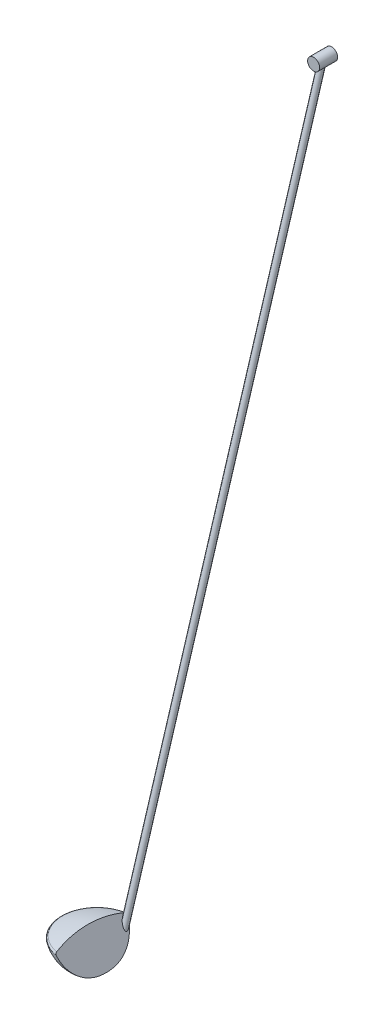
from build123d import *

# Parameters (mm, degrees)
FILLET4_R             = 3
SKETCH6_W             = 30
SKETCH6_H             = 10
SKETCH11_R            = 77.843773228
CLUB_HEAD_ANGLE_DEPTH = 1189.467561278


with BuildPart() as part:
    # Sketch4 → Club Head (revolve)
    with BuildSketch(Plane(origin=(0, 0, 0), x_dir=(0, 0, -1), z_dir=(1, 0, 0))):
        with BuildLine():
            Line((7, 0), (0, 0))
            Line((0, 0), (0, 55))
            ThreePointArc((0, 55), (30.413812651, 52.482875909), (60, 45))
            ThreePointArc((60, 45), (41.763486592, 12.767449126), (7, 0))
        make_face()
    revolve(axis=Axis((0, 55, 0), (0, -1, 0)))

    # Fillet4
    fillet4_edges = [part.edges().sort_by_distance(p)[0] for p in [
        (0, 45, 60),
    ]]
    fillet(fillet4_edges, radius=FILLET4_R)

    # Sketch11 → Club Head Angle (cut, through all)
    with BuildSketch(Plane(origin=(11.907849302, 6.875, 0), x_dir=(0, 0, -1), z_dir=(0.866025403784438, 0.5000000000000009, 0))):
        with Locations((0, 23.815698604)):
            Circle(SKETCH11_R)
    extrude(amount=CLUB_HEAD_ANGLE_DEPTH, mode=Mode.SUBTRACT)



with BuildPart() as body_2:
    # Sketch6 → Point of Rotation (revolve)
    with BuildSketch(Plane(origin=(-5, 0, 0), x_dir=(0, 0, -1), z_dir=(1, 0, 0)), mode=Mode.PRIVATE) as point_of_rotation_sk:
        with Locations((380, 1120.5)):
            Rectangle(SKETCH6_W, SKETCH6_H)
    revolve(point_of_rotation_sk.sketch.rotate(Axis((-5, 1115.5, -365), (0, 0, -1)), 90), axis=Axis((-5, 1115.5, -365), (0, 0, -1)))


with BuildPart() as part_1:
    add(part.part)

    add(body_2.part)  # Club Arm merges body 2
    # Sketch5 → Club Arm (revolve)
    with BuildSketch(Plane(origin=(-5, 0, 0), x_dir=(0, 0, -1), z_dir=(1, 0, 0)), mode=Mode.PRIVATE) as club_arm_sk:
        Polygon((53.865722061, 23.175324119), (385.614901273, 1116.972143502), (380.830138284, 1118.423364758), (54.445687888, 42.314376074), (48.698729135, 23.366310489), align=None)
    revolve(club_arm_sk.sketch.rotate(Axis((-5, 1118.423364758, -380.830138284), (0, -0.9569525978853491, 0.2902442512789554)), 180), axis=Axis((-5, 1118.423364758, -380.830138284), (0, -0.9569525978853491, 0.2902442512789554)))


solid = part_1.part
